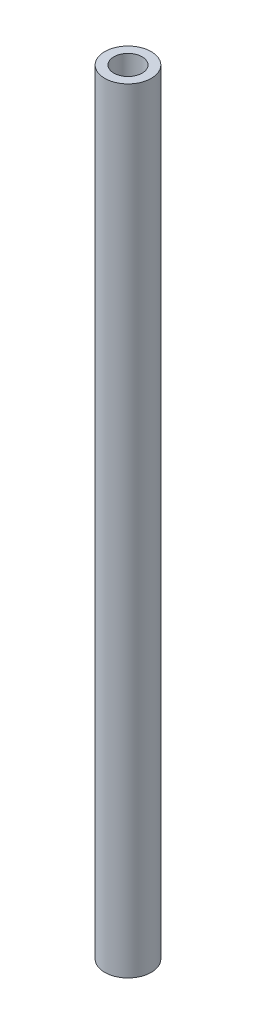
from build123d import *

# Parameters (mm, degrees)
ESQUISSE1_W = 5.85
ESQUISSE1_H = 500


with BuildPart() as part:
    # Esquisse1 → R_volution1 (revolve)
    with BuildSketch(Plane.XY, mode=Mode.PRIVATE) as r_volution1_sk:
        with Locations((12.075, 250)):
            Rectangle(ESQUISSE1_W, ESQUISSE1_H)
    revolve(r_volution1_sk.sketch.rotate(Axis((0, 119.70654619, 0), (0, -1, 0)), 90), axis=Axis((0, 119.70654619, 0), (0, -1, 0)))


solid = part.part
